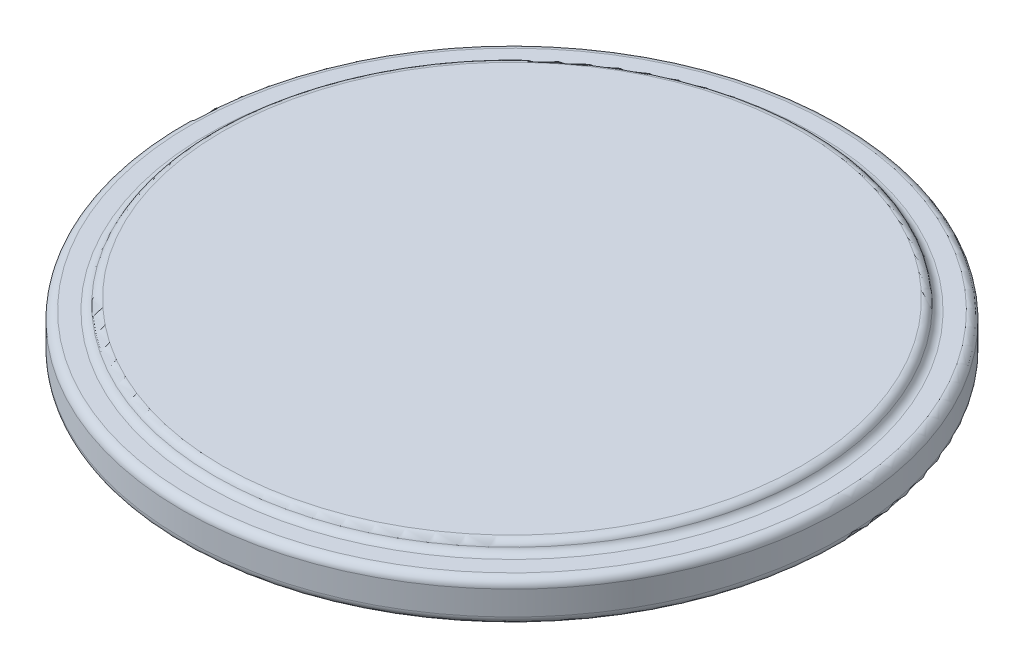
from build123d import *

# Parameters (mm, degrees)
FILLET1_R          = 0.508
SKETCH2_OUTSIDE_W  = 54.292
SKETCH2_OUTSIDE_H  = 54.292
SKETCH2_OUTSIDE_R  = 18.288
CUT_EXTRUDE1_DEPTH = 0.635
FILLET2_R          = 0.508
FILLET3_R          = 0.508


with BuildPart() as part:
    # Sketch1 → Revolve1 (revolve)
    with BuildSketch(Plane(origin=(0, 0, 0), x_dir=(0, 0, -1), z_dir=(1, 0, 0))):
        Polygon((0, 0), (8.89, 0), (20.32, 6.599113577), (20.32, 9.525), (0, 9.525), align=None)
    revolve(axis=Axis((0, 0, 0), (0, 1, 0)))

    # Fillet1
    fillet1_edges = [part.edges().sort_by_distance(p)[0] for p in [
        (0, 9.525, 20.32),
        (0, 6.599113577, 20.32),
        (0, 0, 8.89),
    ]]
    fillet(fillet1_edges, radius=FILLET1_R)

    # Sketch2 outside → Cut-Extrude1 (cut)
    with BuildSketch(Plane(origin=(0, 9.525, 0), x_dir=(1, 0, 0), z_dir=(0, 1, 0))):
        Rectangle(SKETCH2_OUTSIDE_W, SKETCH2_OUTSIDE_H)
        with Locations(Location((0, 0, 0), (0, 0, 270))):
            Circle(SKETCH2_OUTSIDE_R, mode=Mode.SUBTRACT)
    extrude(amount=-CUT_EXTRUDE1_DEPTH, mode=Mode.SUBTRACT)

    # Fillet2
    fillet2_edges = [part.edges().sort_by_distance(p)[0] for p in [
        (0, 8.89, 20.32),
        (0, 8.89, -18.288),
    ]]
    fillet(fillet2_edges, radius=FILLET2_R)

    # Fillet3
    fillet3_edges = [part.edges().sort_by_distance(p)[0] for p in [
        (0, 9.525, -18.288),
    ]]
    fillet(fillet3_edges, radius=FILLET3_R)


solid = part.part
